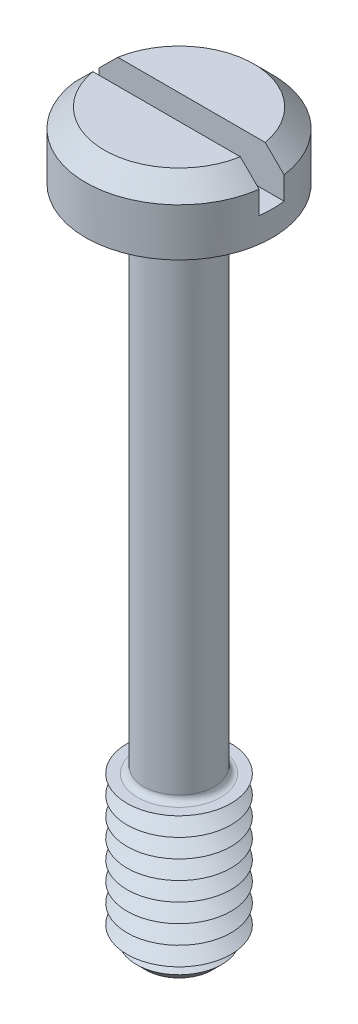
from build123d import *

# Parameters (mm, degrees)
SKETCH1_R           = 2.25
BOSS_EXTRUDE1_DEPTH = 1.6
SKETCH2_R           = 0.85
BOSS_EXTRUDE2_DEPTH = 16
SKETCH3_R           = 1.25
BOSS_EXTRUDE3_DEPTH = 3.7
CHAMFER1_SIZE       = 0.45
LPATTERN1_COUNT     = 8
LPATTERN1_PITCH     = 0.45
FILLET1_R           = 0.15
CHAMFER2_SIZE       = 0.45
SKETCH6_W           = 4.5
SKETCH6_H           = 0.6
CUT_EXTRUDE1_DEPTH  = 1


with BuildPart() as part:
    # Sketch1 → Boss-Extrude1 (new body)
    with BuildSketch(Plane(origin=(0, 0, 0), x_dir=(1, 0, 0), z_dir=(0, 1, 0))):
        with Locations(Location((0, 0, 0), (0, 0, 270))):
            Circle(SKETCH1_R)
    extrude(amount=BOSS_EXTRUDE1_DEPTH)

    # Sketch2 → Boss-Extrude2 (add)
    with BuildSketch(Plane.XZ):
        with Locations(Location((0, 0, 0), (0, 0, 270))):
            Circle(SKETCH2_R)
    extrude(amount=BOSS_EXTRUDE2_DEPTH)

    # Sketch3 → Boss-Extrude3 (add)
    with BuildSketch(Plane.XZ.offset(16)):
        with Locations(Location((0, 0, 0), (0, 0, 270))):
            Circle(SKETCH3_R)
    extrude(amount=-BOSS_EXTRUDE3_DEPTH)

    # Chamfer1
    chamfer1_edges = [part.edges().sort_by_distance(p)[0] for p in [
        (0, -16, 1.25),
    ]]
    chamfer(chamfer1_edges, length=CHAMFER1_SIZE)

    # Sketch5 → Cut-Revolve1 (revolve, cut)
    with BuildSketch(Plane(origin=(0, 0, 0), x_dir=(0, 0, -1), z_dir=(1, 0, 0))):
        Polygon((-1.25, -12.3), (-0.860288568, -12.525), (-1.25, -12.75), align=None)
    cut_revolve1 = revolve(axis=Axis((0, -6.58711856, 0), (0, -1, 0)), mode=Mode.SUBTRACT)

    # LPattern1: Cut-Revolve1 ×8
    with Locations(*[(0, -i * LPATTERN1_PITCH, 0) for i in range(1, LPATTERN1_COUNT)]):
        add(cut_revolve1, mode=Mode.SUBTRACT)

    # Fillet1
    fillet1_edges = [part.edges().sort_by_distance(p)[0] for p in [
        (0, 0, 0.85),
        (0, -12.3, 0.85),
    ]]
    fillet(fillet1_edges, radius=FILLET1_R)

    # Chamfer2
    chamfer2_edges = [part.edges().sort_by_distance(p)[0] for p in [
        (0, 1.6, -2.25),
    ]]
    chamfer(chamfer2_edges, length=CHAMFER2_SIZE)

    # Sketch6 → Cut-Extrude1 (cut)
    with BuildSketch(Plane(origin=(0, 1.6, 0), x_dir=(1, 0, 0), z_dir=(0, 1, 0))):
        Rectangle(SKETCH6_W, SKETCH6_H)
    extrude(amount=-CUT_EXTRUDE1_DEPTH, mode=Mode.SUBTRACT)


solid = part.part
